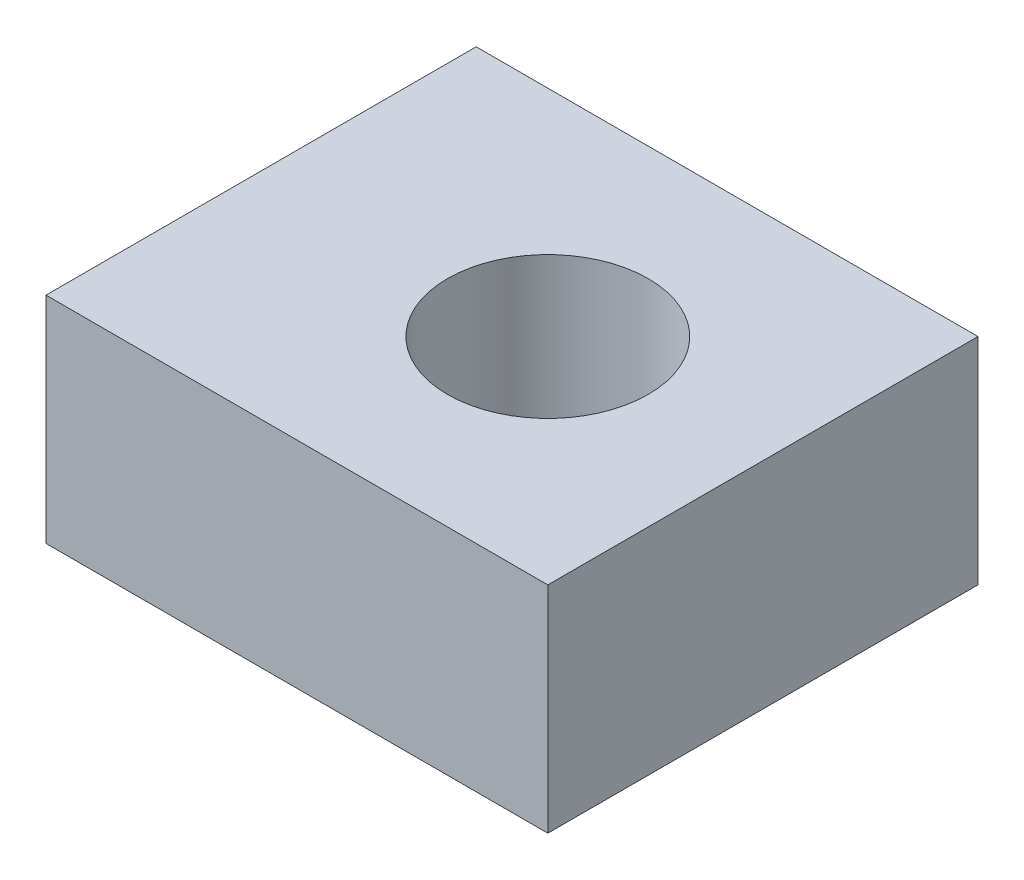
ISO-10303-21;
HEADER;
FILE_DESCRIPTION(('STEP AP214'),'2;1');
FILE_NAME('part.step','',(''),(''),'','','');
FILE_SCHEMA(('AUTOMOTIVE_DESIGN { 1 0 10303 214 1 1 1 1 }'));
ENDSEC;
DATA;
#1=APPLICATION_CONTEXT('core data for automotive mechanical design processes');
#2=APPLICATION_PROTOCOL_DEFINITION('international standard','automotive_design',2000,#1);
#3=PRODUCT_CONTEXT('',#1,'mechanical');
#4=PRODUCT('Part','Part','',(#3));
#5=PRODUCT_RELATED_PRODUCT_CATEGORY('part','',(#4));
#6=PRODUCT_DEFINITION_FORMATION('','',#4);
#7=PRODUCT_DEFINITION_CONTEXT('part definition',#1,'design');
#8=PRODUCT_DEFINITION('design','',#6,#7);
#9=PRODUCT_DEFINITION_SHAPE('','',#8);
#10=(LENGTH_UNIT() NAMED_UNIT(*) SI_UNIT(.MILLI.,.METRE.));
#11=(NAMED_UNIT(*) PLANE_ANGLE_UNIT() SI_UNIT($,.RADIAN.));
#12=(NAMED_UNIT(*) SI_UNIT($,.STERADIAN.) SOLID_ANGLE_UNIT());
#13=UNCERTAINTY_MEASURE_WITH_UNIT(LENGTH_MEASURE(1.E-05),#10,'distance_accuracy_value','');
#14=(GEOMETRIC_REPRESENTATION_CONTEXT(3) GLOBAL_UNCERTAINTY_ASSIGNED_CONTEXT((#13)) GLOBAL_UNIT_ASSIGNED_CONTEXT((#10,
#11,#12)) REPRESENTATION_CONTEXT('',''));
#15=CARTESIAN_POINT('',(0.,0.,0.));
#16=DIRECTION('',(0.,0.,1.));
#17=DIRECTION('',(1.,0.,0.));
#18=AXIS2_PLACEMENT_3D('',#15,#16,#17);
#19=CARTESIAN_POINT('',(0.,0.,30.));
#20=DIRECTION('',(1.,0.,0.));
#21=DIRECTION('',(0.,1.,0.));
#22=AXIS2_PLACEMENT_3D('',#19,#20,#21);
#23=PLANE('',#22);
#24=DIRECTION('',(0.,-1.,0.));
#25=VECTOR('',#24,1.);
#26=CARTESIAN_POINT('',(0.,0.,0.));
#27=LINE('',#26,#25);
#28=CARTESIAN_POINT('',(0.,15.,0.));
#29=VERTEX_POINT('',#28);
#30=CARTESIAN_POINT('',(0.,0.,0.));
#31=VERTEX_POINT('',#30);
#32=EDGE_CURVE('E70',#29,#31,#27,.T.);
#33=ORIENTED_EDGE('',*,*,#32,.T.);
#34=DIRECTION('',(0.,0.,-1.));
#35=VECTOR('',#34,1.);
#36=CARTESIAN_POINT('',(0.,0.,30.));
#37=LINE('',#36,#35);
#38=CARTESIAN_POINT('',(0.,0.,30.));
#39=VERTEX_POINT('',#38);
#40=EDGE_CURVE('E11',#39,#31,#37,.T.);
#41=ORIENTED_EDGE('',*,*,#40,.F.);
#42=DIRECTION('',(0.,-1.,0.));
#43=VECTOR('',#42,1.);
#44=CARTESIAN_POINT('',(0.,0.,30.));
#45=LINE('',#44,#43);
#46=CARTESIAN_POINT('',(0.,15.,30.));
#47=VERTEX_POINT('',#46);
#48=EDGE_CURVE('E93',#47,#39,#45,.T.);
#49=ORIENTED_EDGE('',*,*,#48,.F.);
#50=DIRECTION('',(0.,0.,-1.));
#51=VECTOR('',#50,1.);
#52=CARTESIAN_POINT('',(0.,15.,30.));
#53=LINE('',#52,#51);
#54=EDGE_CURVE('E82',#47,#29,#53,.T.);
#55=ORIENTED_EDGE('',*,*,#54,.T.);
#56=EDGE_LOOP('',(#33,#41,#49,#55));
#57=FACE_BOUND('',#56,.T.);
#58=ADVANCED_FACE('F26',(#57),#23,.F.);
#59=CARTESIAN_POINT('',(0.,0.,30.));
#60=DIRECTION('',(0.,1.,0.));
#61=DIRECTION('',(0.,0.,1.));
#62=AXIS2_PLACEMENT_3D('',#59,#60,#61);
#63=PLANE('',#62);
#64=CARTESIAN_POINT('',(20.,0.,15.));
#65=DIRECTION('',(0.,1.,0.));
#66=DIRECTION('',(0.,0.,1.));
#67=AXIS2_PLACEMENT_3D('',#64,#65,#66);
#68=CIRCLE('',#67,7.);
#69=CARTESIAN_POINT('',(20.,0.,22.));
#70=VERTEX_POINT('',#69);
#71=EDGE_CURVE('E83',#70,#70,#68,.T.);
#72=ORIENTED_EDGE('',*,*,#71,.T.);
#73=EDGE_LOOP('',(#72));
#74=FACE_BOUND('',#73,.T.);
#75=DIRECTION('',(1.,0.,0.));
#76=VECTOR('',#75,1.);
#77=CARTESIAN_POINT('',(0.,0.,0.));
#78=LINE('',#77,#76);
#79=CARTESIAN_POINT('',(35.,0.,0.));
#80=VERTEX_POINT('',#79);
#81=EDGE_CURVE('E66',#31,#80,#78,.T.);
#82=ORIENTED_EDGE('',*,*,#81,.T.);
#83=DIRECTION('',(0.,0.,-1.));
#84=VECTOR('',#83,1.);
#85=CARTESIAN_POINT('',(35.,0.,30.));
#86=LINE('',#85,#84);
#87=CARTESIAN_POINT('',(35.,0.,30.));
#88=VERTEX_POINT('',#87);
#89=EDGE_CURVE('E33',#88,#80,#86,.T.);
#90=ORIENTED_EDGE('',*,*,#89,.F.);
#91=DIRECTION('',(1.,0.,0.));
#92=VECTOR('',#91,1.);
#93=CARTESIAN_POINT('',(0.,0.,30.));
#94=LINE('',#93,#92);
#95=EDGE_CURVE('E78',#39,#88,#94,.T.);
#96=ORIENTED_EDGE('',*,*,#95,.F.);
#97=ORIENTED_EDGE('',*,*,#40,.T.);
#98=EDGE_LOOP('',(#82,#90,#96,#97));
#99=FACE_BOUND('',#98,.T.);
#100=ADVANCED_FACE('F77',(#74,#99),#63,.F.);
#101=CARTESIAN_POINT('',(35.,0.,30.));
#102=DIRECTION('',(-1.,0.,0.));
#103=DIRECTION('',(0.,-1.,0.));
#104=AXIS2_PLACEMENT_3D('',#101,#102,#103);
#105=PLANE('',#104);
#106=DIRECTION('',(0.,1.,0.));
#107=VECTOR('',#106,1.);
#108=CARTESIAN_POINT('',(35.,0.,0.));
#109=LINE('',#108,#107);
#110=CARTESIAN_POINT('',(35.,15.,0.));
#111=VERTEX_POINT('',#110);
#112=EDGE_CURVE('E71',#80,#111,#109,.T.);
#113=ORIENTED_EDGE('',*,*,#112,.T.);
#114=DIRECTION('',(0.,0.,-1.));
#115=VECTOR('',#114,1.);
#116=CARTESIAN_POINT('',(35.,15.,30.));
#117=LINE('',#116,#115);
#118=CARTESIAN_POINT('',(35.,15.,30.));
#119=VERTEX_POINT('',#118);
#120=EDGE_CURVE('E99',#119,#111,#117,.T.);
#121=ORIENTED_EDGE('',*,*,#120,.F.);
#122=DIRECTION('',(0.,1.,0.));
#123=VECTOR('',#122,1.);
#124=CARTESIAN_POINT('',(35.,0.,30.));
#125=LINE('',#124,#123);
#126=EDGE_CURVE('E45',#88,#119,#125,.T.);
#127=ORIENTED_EDGE('',*,*,#126,.F.);
#128=ORIENTED_EDGE('',*,*,#89,.T.);
#129=EDGE_LOOP('',(#113,#121,#127,#128));
#130=FACE_BOUND('',#129,.T.);
#131=ADVANCED_FACE('F102',(#130),#105,.F.);
#132=CARTESIAN_POINT('',(0.,15.,30.));
#133=DIRECTION('',(0.,-1.,0.));
#134=DIRECTION('',(0.,0.,-1.));
#135=AXIS2_PLACEMENT_3D('',#132,#133,#134);
#136=PLANE('',#135);
#137=CARTESIAN_POINT('',(20.,15.,15.));
#138=DIRECTION('',(0.,1.,0.));
#139=DIRECTION('',(0.,0.,1.));
#140=AXIS2_PLACEMENT_3D('',#137,#138,#139);
#141=CIRCLE('',#140,7.);
#142=CARTESIAN_POINT('',(20.,15.,22.));
#143=VERTEX_POINT('',#142);
#144=EDGE_CURVE('E86',#143,#143,#141,.T.);
#145=ORIENTED_EDGE('',*,*,#144,.F.);
#146=EDGE_LOOP('',(#145));
#147=FACE_BOUND('',#146,.T.);
#148=DIRECTION('',(-1.,0.,0.));
#149=VECTOR('',#148,1.);
#150=CARTESIAN_POINT('',(0.,15.,0.));
#151=LINE('',#150,#149);
#152=EDGE_CURVE('E91',#111,#29,#151,.T.);
#153=ORIENTED_EDGE('',*,*,#152,.T.);
#154=ORIENTED_EDGE('',*,*,#54,.F.);
#155=DIRECTION('',(-1.,0.,0.));
#156=VECTOR('',#155,1.);
#157=CARTESIAN_POINT('',(0.,15.,30.));
#158=LINE('',#157,#156);
#159=EDGE_CURVE('E40',#119,#47,#158,.T.);
#160=ORIENTED_EDGE('',*,*,#159,.F.);
#161=ORIENTED_EDGE('',*,*,#120,.T.);
#162=EDGE_LOOP('',(#153,#154,#160,#161));
#163=FACE_BOUND('',#162,.T.);
#164=ADVANCED_FACE('F104',(#147,#163),#136,.F.);
#165=CARTESIAN_POINT('',(0.,15.,30.));
#166=DIRECTION('',(0.,0.,-1.));
#167=DIRECTION('',(-1.,0.,0.));
#168=AXIS2_PLACEMENT_3D('',#165,#166,#167);
#169=PLANE('',#168);
#170=ORIENTED_EDGE('',*,*,#48,.T.);
#171=ORIENTED_EDGE('',*,*,#95,.T.);
#172=ORIENTED_EDGE('',*,*,#126,.T.);
#173=ORIENTED_EDGE('',*,*,#159,.T.);
#174=EDGE_LOOP('',(#170,#171,#172,#173));
#175=FACE_BOUND('',#174,.T.);
#176=ADVANCED_FACE('F105',(#175),#169,.F.);
#177=CARTESIAN_POINT('',(0.,15.,0.));
#178=DIRECTION('',(0.,0.,-1.));
#179=DIRECTION('',(-1.,0.,0.));
#180=AXIS2_PLACEMENT_3D('',#177,#178,#179);
#181=PLANE('',#180);
#182=ORIENTED_EDGE('',*,*,#32,.F.);
#183=ORIENTED_EDGE('',*,*,#152,.F.);
#184=ORIENTED_EDGE('',*,*,#112,.F.);
#185=ORIENTED_EDGE('',*,*,#81,.F.);
#186=EDGE_LOOP('',(#182,#183,#184,#185));
#187=FACE_BOUND('',#186,.T.);
#188=ADVANCED_FACE('F67',(#187),#181,.T.);
#189=CARTESIAN_POINT('',(20.,15.,15.));
#190=DIRECTION('',(0.,1.,0.));
#191=DIRECTION('',(0.,0.,1.));
#192=AXIS2_PLACEMENT_3D('',#189,#190,#191);
#193=CYLINDRICAL_SURFACE('',#192,7.);
#194=ORIENTED_EDGE('',*,*,#144,.T.);
#195=EDGE_LOOP('',(#194));
#196=FACE_BOUND('',#195,.T.);
#197=ORIENTED_EDGE('',*,*,#71,.F.);
#198=EDGE_LOOP('',(#197));
#199=FACE_BOUND('',#198,.T.);
#200=ADVANCED_FACE('F112',(#196,#199),#193,.F.);
#201=CLOSED_SHELL('',(#58,#100,#131,#164,#176,#188,#200));
#202=MANIFOLD_SOLID_BREP('B2',#201);
#203=ADVANCED_BREP_SHAPE_REPRESENTATION('',(#18,#202),#14);
#204=SHAPE_DEFINITION_REPRESENTATION(#9,#203);
ENDSEC;
END-ISO-10303-21;
